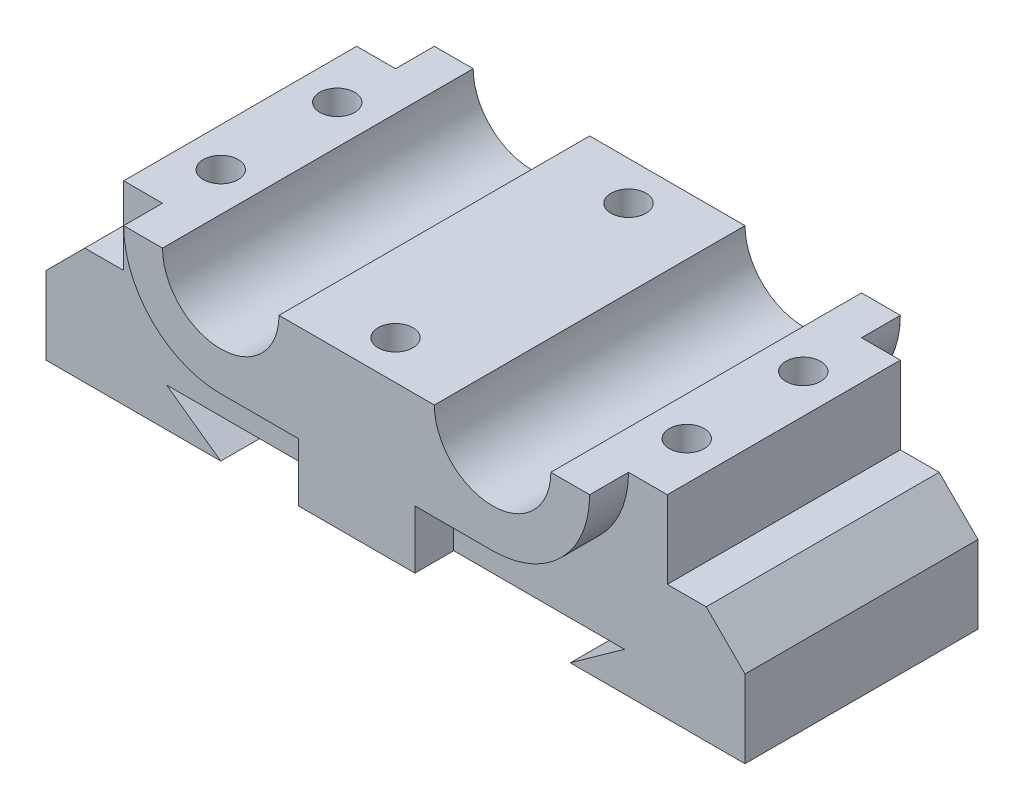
from build123d import *

# Parameters (mm, degrees)
BOSS_EXTRUDE1_DEPTH = 15
BOSS_EXTRUDE8_DEPTH = 20
CHAMFER2_SIZE       = 5
SKETCH7_R           = 2.25
CUT_EXTRUDE2_DEPTH  = 15


with BuildPart() as part:
    # Sketch1 → Boss-Extrude1 (new, symmetric)
    with BuildSketch(Plane.XY):
        with BuildLine():
            Line((-45, 0), (-22.5, 0))
            Line((-22.5, 0), (-29.471830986, 5))
            Line((-29.471830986, 5), (-7.5, 5))
            Line((-7.5, 5), (29.471830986, 5))
            Line((29.471830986, 5), (22.5, 0))
            Line((22.5, 0), (45, 0))
            Line((45, 0), (45, 15))
            Line((45, 15), (35, 15))
            Line((35, 15), (35, 25))
            Line((35, 25), (30, 25))
            ThreePointArc((30, 25), (26.338834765, 16.161165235), (17.5, 12.5))
            Line((17.5, 12.5), (7.5, 12.5))
            Line((7.5, 12.5), (-17.5, 12.5))
            ThreePointArc((-17.5, 12.5), (-26.338834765, 16.161165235), (-30, 25))
            Line((-30, 25), (-35, 25))
            Line((-35, 25), (-35, 15))
            Line((-35, 15), (-45, 15))
            Line((-45, 15), (-45, 0))
        make_face()
    extrude(amount=BOSS_EXTRUDE1_DEPTH, both=True)

    # Sketch6 → Boss-Extrude8 (add, symmetric)
    with BuildSketch(Plane.XY):
        with BuildLine():
            ThreePointArc((17.5, 12.5), (26.338834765, 16.161165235), (30, 25))
            Line((30, 25), (25, 25))
            ThreePointArc((25, 25), (17.5, 17.5), (10, 25))
            Line((10, 25), (-10, 25))
            ThreePointArc((-10, 25), (-17.5, 17.5), (-25, 25))
            Line((-25, 25), (-30, 25))
            ThreePointArc((-30, 25), (-26.338834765, 16.161165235), (-17.5, 12.5))
            Line((-17.5, 12.5), (-7.5, 12.5))
            Line((-7.5, 12.5), (-7.5, 5))
            Line((-7.5, 5), (7.5, 5))
            Line((7.5, 5), (7.5, 12.5))
            Line((7.5, 12.5), (17.5, 12.5))
        make_face()
    extrude(amount=BOSS_EXTRUDE8_DEPTH, both=True)

    # Chamfer2
    chamfer2_edges = [part.edges().sort_by_distance(p)[0] for p in [
        (-45, 15, 0),
        (45, 15, 0),
    ]]
    chamfer(chamfer2_edges, length=CHAMFER2_SIZE)

    # Sketch7 → Cut-Extrude2 (cut)
    with BuildSketch(Plane(origin=(0, 25, 0), x_dir=(1, 0, 0), z_dir=(0, 1, 0))):
        with Locations(Location((0, 15, 0), (0, 0, 270))):
            Circle(SKETCH7_R)
        with Locations(Location((-30, 7.5, 0), (0, 0, 270))):
            Circle(SKETCH7_R)
        with Locations(Location((-30, -7.5, 0), (0, 0, 90))):
            Circle(SKETCH7_R)
        with Locations(Location((0, -15, 0), (0, 0, 90))):
            Circle(SKETCH7_R)
        with Locations(Location((30, -7.5, 0), (0, 0, 270))):
            Circle(SKETCH7_R)
        with Locations(Location((30, 7.5, 0), (0, 0, 90))):
            Circle(SKETCH7_R)
    extrude(amount=-CUT_EXTRUDE2_DEPTH, mode=Mode.SUBTRACT)


solid = part.part
